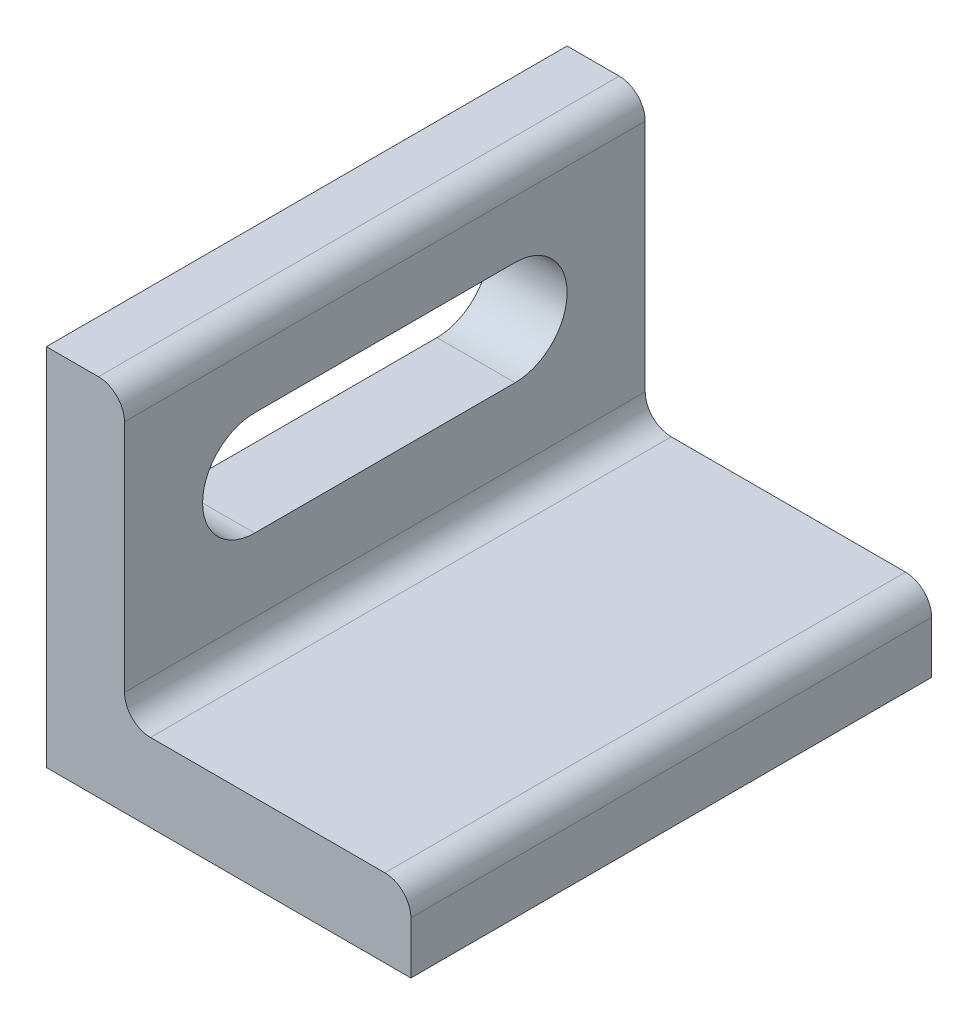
from build123d import *

# Parameters (mm, degrees)
EXTRUDE_1_DEPTH     = 100
CUT_EXTRUDE_1_DEPTH = 20
FILLET_22_R         = 5


with BuildPart() as part:
    # Sketch 1 → Extrude 1 (new body)
    with BuildSketch(Plane.XY):
        Polygon((0, 0), (70, 0), (70, 15), (15, 15), (15, 70), (0, 70), align=None)
    extrude(amount=EXTRUDE_1_DEPTH)

    # Sketch 4 → Cut-Extrude 1 (cut)
    with BuildSketch(Plane(origin=(15, 0, 0), x_dir=(0, 0, -1), z_dir=(1, 0, 0))):
        with BuildLine():
            Line((-75, 54), (-25, 54))
            ThreePointArc((-25, 54), (-15, 44), (-25, 34))
            Line((-25, 34), (-75, 34))
            ThreePointArc((-75, 34), (-85, 44), (-75, 54))
        make_face()
    extrude(amount=-CUT_EXTRUDE_1_DEPTH, mode=Mode.SUBTRACT)

    # Fillet 22
    fillet_22_edges = [part.edges().sort_by_distance(p)[0] for p in [
        (70, 15, 50),
        (15, 15, 50),
        (15, 70, 50),
    ]]
    fillet(fillet_22_edges, radius=FILLET_22_R)


solid = part.part
